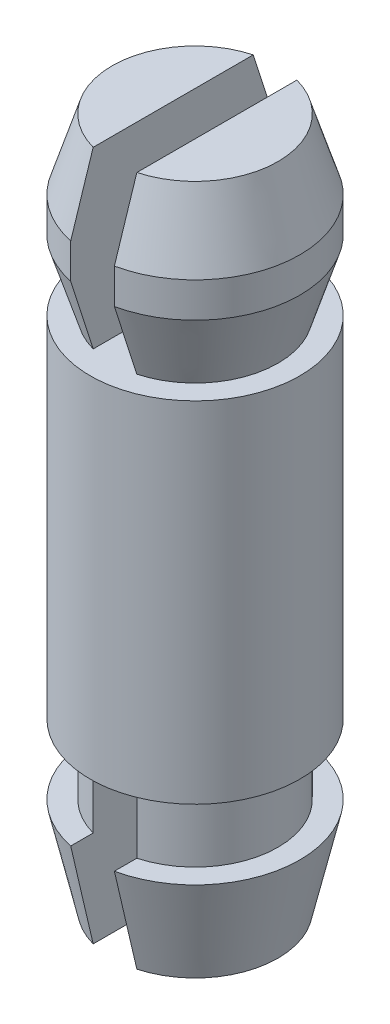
from build123d import *

# Parameters (mm, degrees)
CUT_EXTRUDE_1_DEPTH      = 13.470765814
CUT_EXTRUDE_1_DEPTH_BACK = 13.470765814
SKETCH_2_W               = 1
SKETCH_2_H               = 4
SKETCH_2_H_2             = 3.8


with BuildPart() as part:
    # Sketch 1 → Revolve 1 (revolve)
    with BuildSketch(Plane.XY, mode=Mode.PRIVATE) as revolve_1_sk:
        Polygon((0, -3.8), (1.9, -3.8), (2.4, -1.6), (1.9, -1.6), (1.9, 0), (2.4, 0), (2.4, 8), (1.9, 8), (2.4, 9.6), (2.4, 10.4), (1.9, 12), (0, 12), align=None)
    revolve(revolve_1_sk.sketch.rotate(Axis((0, -3.8, 0), (0, 1, 0)), 90), axis=Axis((0, -3.8, 0), (0, 1, 0)))

    # Sketch 2 → Cut-Extrude 1 (cut, two sides: drawn at the far end of the back side and taken through both)
    with BuildSketch(Plane.XY.offset(-CUT_EXTRUDE_1_DEPTH_BACK)):
        with Locations((0, 10)):
            Rectangle(SKETCH_2_W, SKETCH_2_H)
        with Locations((0, -1.9)):
            Rectangle(SKETCH_2_W, SKETCH_2_H_2)
    extrude(amount=CUT_EXTRUDE_1_DEPTH + CUT_EXTRUDE_1_DEPTH_BACK, mode=Mode.SUBTRACT)


solid = part.part
